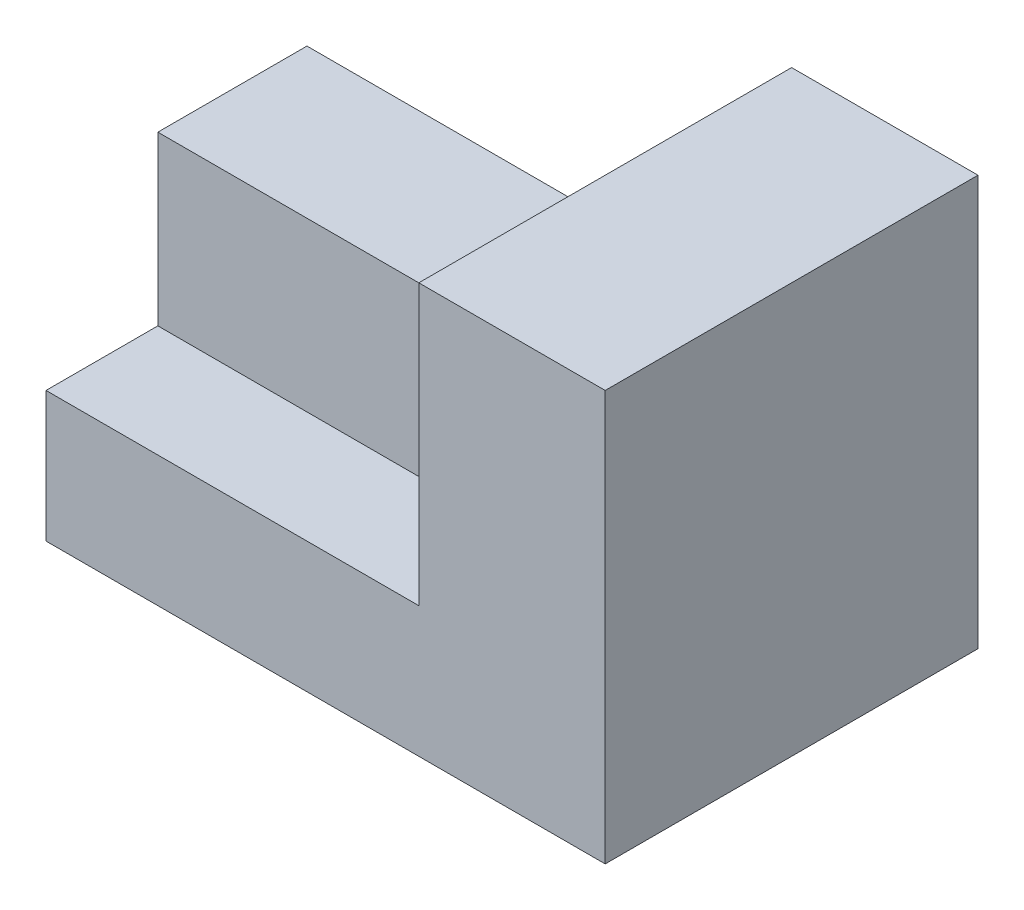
ISO-10303-21;
HEADER;
FILE_DESCRIPTION(('STEP AP214'),'2;1');
FILE_NAME('part.step','',(''),(''),'','','');
FILE_SCHEMA(('AUTOMOTIVE_DESIGN { 1 0 10303 214 1 1 1 1 }'));
ENDSEC;
DATA;
#1=APPLICATION_CONTEXT('core data for automotive mechanical design processes');
#2=APPLICATION_PROTOCOL_DEFINITION('international standard','automotive_design',2000,#1);
#3=PRODUCT_CONTEXT('',#1,'mechanical');
#4=PRODUCT('Part','Part','',(#3));
#5=PRODUCT_RELATED_PRODUCT_CATEGORY('part','',(#4));
#6=PRODUCT_DEFINITION_FORMATION('','',#4);
#7=PRODUCT_DEFINITION_CONTEXT('part definition',#1,'design');
#8=PRODUCT_DEFINITION('design','',#6,#7);
#9=PRODUCT_DEFINITION_SHAPE('','',#8);
#10=(LENGTH_UNIT() NAMED_UNIT(*) SI_UNIT(.MILLI.,.METRE.));
#11=(NAMED_UNIT(*) PLANE_ANGLE_UNIT() SI_UNIT($,.RADIAN.));
#12=(NAMED_UNIT(*) SI_UNIT($,.STERADIAN.) SOLID_ANGLE_UNIT());
#13=UNCERTAINTY_MEASURE_WITH_UNIT(LENGTH_MEASURE(1.E-05),#10,'distance_accuracy_value','');
#14=(GEOMETRIC_REPRESENTATION_CONTEXT(3) GLOBAL_UNCERTAINTY_ASSIGNED_CONTEXT((#13)) GLOBAL_UNIT_ASSIGNED_CONTEXT((#10,
#11,#12)) REPRESENTATION_CONTEXT('',''));
#15=CARTESIAN_POINT('',(0.,0.,0.));
#16=DIRECTION('',(0.,0.,1.));
#17=DIRECTION('',(1.,0.,0.));
#18=AXIS2_PLACEMENT_3D('',#15,#16,#17);
#19=CARTESIAN_POINT('',(0.,16.,10.));
#20=DIRECTION('',(1.,0.,0.));
#21=DIRECTION('',(0.,0.,-1.));
#22=AXIS2_PLACEMENT_3D('',#19,#20,#21);
#23=PLANE('',#22);
#24=DIRECTION('',(0.,1.,0.));
#25=VECTOR('',#24,1.);
#26=CARTESIAN_POINT('',(0.,16.,-4.));
#27=LINE('',#26,#25);
#28=CARTESIAN_POINT('',(0.,7.,-4.));
#29=VERTEX_POINT('',#28);
#30=CARTESIAN_POINT('',(0.,16.,-4.));
#31=VERTEX_POINT('',#30);
#32=EDGE_CURVE('E132',#29,#31,#27,.T.);
#33=ORIENTED_EDGE('',*,*,#32,.F.);
#34=DIRECTION('',(0.,0.,1.));
#35=VECTOR('',#34,1.);
#36=CARTESIAN_POINT('',(0.,7.,10.));
#37=LINE('',#36,#35);
#38=CARTESIAN_POINT('',(0.,7.,-10.));
#39=VERTEX_POINT('',#38);
#40=EDGE_CURVE('E124',#39,#29,#37,.T.);
#41=ORIENTED_EDGE('',*,*,#40,.F.);
#42=DIRECTION('',(0.,-1.,0.));
#43=VECTOR('',#42,1.);
#44=CARTESIAN_POINT('',(0.,16.,-10.));
#45=LINE('',#44,#43);
#46=CARTESIAN_POINT('',(0.,0.,-10.));
#47=VERTEX_POINT('',#46);
#48=EDGE_CURVE('E146',#39,#47,#45,.T.);
#49=ORIENTED_EDGE('',*,*,#48,.T.);
#50=DIRECTION('',(0.,0.,-1.));
#51=VECTOR('',#50,1.);
#52=CARTESIAN_POINT('',(0.,0.,10.));
#53=LINE('',#52,#51);
#54=CARTESIAN_POINT('',(0.,0.,10.));
#55=VERTEX_POINT('',#54);
#56=EDGE_CURVE('E178',#55,#47,#53,.T.);
#57=ORIENTED_EDGE('',*,*,#56,.F.);
#58=DIRECTION('',(0.,-1.,0.));
#59=VECTOR('',#58,1.);
#60=CARTESIAN_POINT('',(0.,16.,10.));
#61=LINE('',#60,#59);
#62=CARTESIAN_POINT('',(0.,7.,10.));
#63=VERTEX_POINT('',#62);
#64=EDGE_CURVE('E147',#63,#55,#61,.T.);
#65=ORIENTED_EDGE('',*,*,#64,.F.);
#66=DIRECTION('',(0.,0.,1.));
#67=VECTOR('',#66,1.);
#68=CARTESIAN_POINT('',(0.,7.,10.));
#69=LINE('',#68,#67);
#70=CARTESIAN_POINT('',(0.,7.,4.));
#71=VERTEX_POINT('',#70);
#72=EDGE_CURVE('E53',#71,#63,#69,.T.);
#73=ORIENTED_EDGE('',*,*,#72,.F.);
#74=DIRECTION('',(0.,1.,0.));
#75=VECTOR('',#74,1.);
#76=CARTESIAN_POINT('',(0.,16.,4.));
#77=LINE('',#76,#75);
#78=CARTESIAN_POINT('',(0.,16.,4.));
#79=VERTEX_POINT('',#78);
#80=EDGE_CURVE('E143',#71,#79,#77,.T.);
#81=ORIENTED_EDGE('',*,*,#80,.T.);
#82=DIRECTION('',(0.,0.,-1.));
#83=VECTOR('',#82,1.);
#84=CARTESIAN_POINT('',(0.,16.,10.));
#85=LINE('',#84,#83);
#86=EDGE_CURVE('E157',#79,#31,#85,.T.);
#87=ORIENTED_EDGE('',*,*,#86,.T.);
#88=EDGE_LOOP('',(#33,#41,#49,#57,#65,#73,#81,#87));
#89=FACE_BOUND('',#88,.T.);
#90=ADVANCED_FACE('F31',(#89),#23,.F.);
#91=CARTESIAN_POINT('',(20.,16.,10.));
#92=DIRECTION('',(0.,-1.,0.));
#93=DIRECTION('',(0.,0.,-1.));
#94=AXIS2_PLACEMENT_3D('',#91,#92,#93);
#95=PLANE('',#94);
#96=DIRECTION('',(-1.,0.,0.));
#97=VECTOR('',#96,1.);
#98=CARTESIAN_POINT('',(-1.18773946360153,16.,-4.));
#99=LINE('',#98,#97);
#100=CARTESIAN_POINT('',(20.,16.,-4.));
#101=VERTEX_POINT('',#100);
#102=EDGE_CURVE('E122',#101,#31,#99,.T.);
#103=ORIENTED_EDGE('',*,*,#102,.T.);
#104=ORIENTED_EDGE('',*,*,#86,.F.);
#105=DIRECTION('',(-1.,0.,0.));
#106=VECTOR('',#105,1.);
#107=CARTESIAN_POINT('',(-1.18773946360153,16.,4.));
#108=LINE('',#107,#106);
#109=CARTESIAN_POINT('',(20.,16.,4.));
#110=VERTEX_POINT('',#109);
#111=EDGE_CURVE('E134',#110,#79,#108,.T.);
#112=ORIENTED_EDGE('',*,*,#111,.F.);
#113=DIRECTION('',(0.,0.,-1.));
#114=VECTOR('',#113,1.);
#115=CARTESIAN_POINT('',(20.,16.,10.));
#116=LINE('',#115,#114);
#117=EDGE_CURVE('E168',#110,#101,#116,.T.);
#118=ORIENTED_EDGE('',*,*,#117,.T.);
#119=EDGE_LOOP('',(#103,#104,#112,#118));
#120=FACE_BOUND('',#119,.T.);
#121=ADVANCED_FACE('F211',(#120),#95,.F.);
#122=CARTESIAN_POINT('',(0.,0.,-10.));
#123=DIRECTION('',(0.,0.,1.));
#124=DIRECTION('',(1.,0.,0.));
#125=AXIS2_PLACEMENT_3D('',#122,#123,#124);
#126=PLANE('',#125);
#127=DIRECTION('',(-1.,0.,0.));
#128=VECTOR('',#127,1.);
#129=CARTESIAN_POINT('',(0.,7.,-10.));
#130=LINE('',#129,#128);
#131=CARTESIAN_POINT('',(20.,7.,-10.));
#132=VERTEX_POINT('',#131);
#133=EDGE_CURVE('E11',#132,#39,#130,.T.);
#134=ORIENTED_EDGE('',*,*,#133,.F.);
#135=DIRECTION('',(0.,-1.,0.));
#136=VECTOR('',#135,1.);
#137=CARTESIAN_POINT('',(20.,22.,-10.));
#138=LINE('',#137,#136);
#139=CARTESIAN_POINT('',(20.,22.,-10.));
#140=VERTEX_POINT('',#139);
#141=EDGE_CURVE('E45',#140,#132,#138,.T.);
#142=ORIENTED_EDGE('',*,*,#141,.F.);
#143=DIRECTION('',(-1.,0.,0.));
#144=VECTOR('',#143,1.);
#145=CARTESIAN_POINT('',(30.,22.,-10.));
#146=LINE('',#145,#144);
#147=CARTESIAN_POINT('',(30.,22.,-10.));
#148=VERTEX_POINT('',#147);
#149=EDGE_CURVE('E163',#148,#140,#146,.T.);
#150=ORIENTED_EDGE('',*,*,#149,.F.);
#151=DIRECTION('',(0.,1.,0.));
#152=VECTOR('',#151,1.);
#153=CARTESIAN_POINT('',(30.,0.,-10.));
#154=LINE('',#153,#152);
#155=CARTESIAN_POINT('',(30.,0.,-10.));
#156=VERTEX_POINT('',#155);
#157=EDGE_CURVE('E161',#156,#148,#154,.T.);
#158=ORIENTED_EDGE('',*,*,#157,.F.);
#159=DIRECTION('',(1.,0.,0.));
#160=VECTOR('',#159,1.);
#161=CARTESIAN_POINT('',(0.,0.,-10.));
#162=LINE('',#161,#160);
#163=EDGE_CURVE('E159',#47,#156,#162,.T.);
#164=ORIENTED_EDGE('',*,*,#163,.F.);
#165=ORIENTED_EDGE('',*,*,#48,.F.);
#166=EDGE_LOOP('',(#134,#142,#150,#158,#164,#165));
#167=FACE_BOUND('',#166,.T.);
#168=ADVANCED_FACE('F213',(#167),#126,.F.);
#169=CARTESIAN_POINT('',(0.,0.,10.));
#170=DIRECTION('',(0.,1.,0.));
#171=DIRECTION('',(0.,0.,1.));
#172=AXIS2_PLACEMENT_3D('',#169,#170,#171);
#173=PLANE('',#172);
#174=ORIENTED_EDGE('',*,*,#163,.T.);
#175=DIRECTION('',(0.,0.,-1.));
#176=VECTOR('',#175,1.);
#177=CARTESIAN_POINT('',(30.,0.,10.));
#178=LINE('',#177,#176);
#179=CARTESIAN_POINT('',(30.,0.,10.));
#180=VERTEX_POINT('',#179);
#181=EDGE_CURVE('E175',#180,#156,#178,.T.);
#182=ORIENTED_EDGE('',*,*,#181,.F.);
#183=DIRECTION('',(1.,0.,0.));
#184=VECTOR('',#183,1.);
#185=CARTESIAN_POINT('',(0.,0.,10.));
#186=LINE('',#185,#184);
#187=EDGE_CURVE('E149',#55,#180,#186,.T.);
#188=ORIENTED_EDGE('',*,*,#187,.F.);
#189=ORIENTED_EDGE('',*,*,#56,.T.);
#190=EDGE_LOOP('',(#174,#182,#188,#189));
#191=FACE_BOUND('',#190,.T.);
#192=ADVANCED_FACE('F191',(#191),#173,.F.);
#193=CARTESIAN_POINT('',(30.,0.,10.));
#194=DIRECTION('',(-1.,0.,0.));
#195=DIRECTION('',(0.,0.,1.));
#196=AXIS2_PLACEMENT_3D('',#193,#194,#195);
#197=PLANE('',#196);
#198=ORIENTED_EDGE('',*,*,#157,.T.);
#199=DIRECTION('',(0.,0.,-1.));
#200=VECTOR('',#199,1.);
#201=CARTESIAN_POINT('',(30.,22.,10.));
#202=LINE('',#201,#200);
#203=CARTESIAN_POINT('',(30.,22.,10.));
#204=VERTEX_POINT('',#203);
#205=EDGE_CURVE('E172',#204,#148,#202,.T.);
#206=ORIENTED_EDGE('',*,*,#205,.F.);
#207=DIRECTION('',(0.,1.,0.));
#208=VECTOR('',#207,1.);
#209=CARTESIAN_POINT('',(30.,0.,10.));
#210=LINE('',#209,#208);
#211=EDGE_CURVE('E151',#180,#204,#210,.T.);
#212=ORIENTED_EDGE('',*,*,#211,.F.);
#213=ORIENTED_EDGE('',*,*,#181,.T.);
#214=EDGE_LOOP('',(#198,#206,#212,#213));
#215=FACE_BOUND('',#214,.T.);
#216=ADVANCED_FACE('F198',(#215),#197,.F.);
#217=CARTESIAN_POINT('',(30.,22.,10.));
#218=DIRECTION('',(0.,-1.,0.));
#219=DIRECTION('',(0.,0.,-1.));
#220=AXIS2_PLACEMENT_3D('',#217,#218,#219);
#221=PLANE('',#220);
#222=ORIENTED_EDGE('',*,*,#149,.T.);
#223=DIRECTION('',(0.,0.,-1.));
#224=VECTOR('',#223,1.);
#225=CARTESIAN_POINT('',(20.,22.,10.));
#226=LINE('',#225,#224);
#227=CARTESIAN_POINT('',(20.,22.,10.));
#228=VERTEX_POINT('',#227);
#229=EDGE_CURVE('E170',#228,#140,#226,.T.);
#230=ORIENTED_EDGE('',*,*,#229,.F.);
#231=DIRECTION('',(-1.,0.,0.));
#232=VECTOR('',#231,1.);
#233=CARTESIAN_POINT('',(30.,22.,10.));
#234=LINE('',#233,#232);
#235=EDGE_CURVE('E153',#204,#228,#234,.T.);
#236=ORIENTED_EDGE('',*,*,#235,.F.);
#237=ORIENTED_EDGE('',*,*,#205,.T.);
#238=EDGE_LOOP('',(#222,#230,#236,#237));
#239=FACE_BOUND('',#238,.T.);
#240=ADVANCED_FACE('F202',(#239),#221,.F.);
#241=CARTESIAN_POINT('',(20.,22.,10.));
#242=DIRECTION('',(1.,0.,0.));
#243=DIRECTION('',(0.,0.,-1.));
#244=AXIS2_PLACEMENT_3D('',#241,#242,#243);
#245=PLANE('',#244);
#246=ORIENTED_EDGE('',*,*,#141,.T.);
#247=DIRECTION('',(0.,0.,1.));
#248=VECTOR('',#247,1.);
#249=CARTESIAN_POINT('',(20.,7.,-4.));
#250=LINE('',#249,#248);
#251=CARTESIAN_POINT('',(20.,7.,-4.));
#252=VERTEX_POINT('',#251);
#253=EDGE_CURVE('E106',#132,#252,#250,.T.);
#254=ORIENTED_EDGE('',*,*,#253,.T.);
#255=DIRECTION('',(0.,1.,0.));
#256=VECTOR('',#255,1.);
#257=CARTESIAN_POINT('',(20.,7.,-4.));
#258=LINE('',#257,#256);
#259=EDGE_CURVE('E110',#252,#101,#258,.T.);
#260=ORIENTED_EDGE('',*,*,#259,.T.);
#261=ORIENTED_EDGE('',*,*,#117,.F.);
#262=DIRECTION('',(0.,1.,0.));
#263=VECTOR('',#262,1.);
#264=CARTESIAN_POINT('',(20.,7.,4.));
#265=LINE('',#264,#263);
#266=CARTESIAN_POINT('',(20.,7.,4.));
#267=VERTEX_POINT('',#266);
#268=EDGE_CURVE('E139',#267,#110,#265,.T.);
#269=ORIENTED_EDGE('',*,*,#268,.F.);
#270=DIRECTION('',(0.,0.,-1.));
#271=VECTOR('',#270,1.);
#272=CARTESIAN_POINT('',(20.,7.,4.));
#273=LINE('',#272,#271);
#274=CARTESIAN_POINT('',(20.,7.,10.));
#275=VERTEX_POINT('',#274);
#276=EDGE_CURVE('E135',#275,#267,#273,.T.);
#277=ORIENTED_EDGE('',*,*,#276,.F.);
#278=DIRECTION('',(0.,-1.,0.));
#279=VECTOR('',#278,1.);
#280=CARTESIAN_POINT('',(20.,22.,10.));
#281=LINE('',#280,#279);
#282=EDGE_CURVE('E155',#228,#275,#281,.T.);
#283=ORIENTED_EDGE('',*,*,#282,.F.);
#284=ORIENTED_EDGE('',*,*,#229,.T.);
#285=EDGE_LOOP('',(#246,#254,#260,#261,#269,#277,#283,#284));
#286=FACE_BOUND('',#285,.T.);
#287=ADVANCED_FACE('F108',(#286),#245,.F.);
#288=CARTESIAN_POINT('',(0.,0.,10.));
#289=DIRECTION('',(0.,0.,1.));
#290=DIRECTION('',(1.,0.,0.));
#291=AXIS2_PLACEMENT_3D('',#288,#289,#290);
#292=PLANE('',#291);
#293=ORIENTED_EDGE('',*,*,#282,.T.);
#294=DIRECTION('',(-1.,0.,0.));
#295=VECTOR('',#294,1.);
#296=CARTESIAN_POINT('',(0.,7.,10.));
#297=LINE('',#296,#295);
#298=EDGE_CURVE('E38',#275,#63,#297,.T.);
#299=ORIENTED_EDGE('',*,*,#298,.T.);
#300=ORIENTED_EDGE('',*,*,#64,.T.);
#301=ORIENTED_EDGE('',*,*,#187,.T.);
#302=ORIENTED_EDGE('',*,*,#211,.T.);
#303=ORIENTED_EDGE('',*,*,#235,.T.);
#304=EDGE_LOOP('',(#293,#299,#300,#301,#302,#303));
#305=FACE_BOUND('',#304,.T.);
#306=ADVANCED_FACE('F182',(#305),#292,.T.);
#307=CARTESIAN_POINT('',(-1.18773946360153,7.,4.));
#308=DIRECTION('',(0.,0.,-1.));
#309=DIRECTION('',(-1.,0.,0.));
#310=AXIS2_PLACEMENT_3D('',#307,#308,#309);
#311=PLANE('',#310);
#312=DIRECTION('',(-1.,0.,0.));
#313=VECTOR('',#312,1.);
#314=CARTESIAN_POINT('',(-1.18773946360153,7.,4.));
#315=LINE('',#314,#313);
#316=EDGE_CURVE('E137',#267,#71,#315,.T.);
#317=ORIENTED_EDGE('',*,*,#316,.F.);
#318=ORIENTED_EDGE('',*,*,#268,.T.);
#319=ORIENTED_EDGE('',*,*,#111,.T.);
#320=ORIENTED_EDGE('',*,*,#80,.F.);
#321=EDGE_LOOP('',(#317,#318,#319,#320));
#322=FACE_BOUND('',#321,.T.);
#323=ADVANCED_FACE('F207',(#322),#311,.F.);
#324=CARTESIAN_POINT('',(-1.18773946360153,7.,12.9080459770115));
#325=DIRECTION('',(0.,1.,0.));
#326=DIRECTION('',(0.,0.,1.));
#327=AXIS2_PLACEMENT_3D('',#324,#325,#326);
#328=PLANE('',#327);
#329=ORIENTED_EDGE('',*,*,#72,.T.);
#330=ORIENTED_EDGE('',*,*,#298,.F.);
#331=ORIENTED_EDGE('',*,*,#276,.T.);
#332=ORIENTED_EDGE('',*,*,#316,.T.);
#333=EDGE_LOOP('',(#329,#330,#331,#332));
#334=FACE_BOUND('',#333,.T.);
#335=ADVANCED_FACE('F205',(#334),#328,.T.);
#336=CARTESIAN_POINT('',(-1.18773946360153,7.,-4.));
#337=DIRECTION('',(0.,0.,-1.));
#338=DIRECTION('',(-1.,0.,0.));
#339=AXIS2_PLACEMENT_3D('',#336,#337,#338);
#340=PLANE('',#339);
#341=ORIENTED_EDGE('',*,*,#32,.T.);
#342=ORIENTED_EDGE('',*,*,#102,.F.);
#343=ORIENTED_EDGE('',*,*,#259,.F.);
#344=DIRECTION('',(-1.,0.,0.));
#345=VECTOR('',#344,1.);
#346=CARTESIAN_POINT('',(-1.18773946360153,7.,-4.));
#347=LINE('',#346,#345);
#348=EDGE_CURVE('E115',#252,#29,#347,.T.);
#349=ORIENTED_EDGE('',*,*,#348,.T.);
#350=EDGE_LOOP('',(#341,#342,#343,#349));
#351=FACE_BOUND('',#350,.T.);
#352=ADVANCED_FACE('F119',(#351),#340,.T.);
#353=CARTESIAN_POINT('',(-1.18773946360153,7.,-12.9080459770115));
#354=DIRECTION('',(0.,1.,0.));
#355=DIRECTION('',(0.,0.,-1.));
#356=AXIS2_PLACEMENT_3D('',#353,#354,#355);
#357=PLANE('',#356);
#358=ORIENTED_EDGE('',*,*,#40,.T.);
#359=ORIENTED_EDGE('',*,*,#348,.F.);
#360=ORIENTED_EDGE('',*,*,#253,.F.);
#361=ORIENTED_EDGE('',*,*,#133,.T.);
#362=EDGE_LOOP('',(#358,#359,#360,#361));
#363=FACE_BOUND('',#362,.T.);
#364=ADVANCED_FACE('F126',(#363),#357,.T.);
#365=CLOSED_SHELL('',(#90,#121,#168,#192,#216,#240,#287,#306,#323,#335,#352,#364));
#366=MANIFOLD_SOLID_BREP('B2',#365);
#367=ADVANCED_BREP_SHAPE_REPRESENTATION('',(#18,#366),#14);
#368=SHAPE_DEFINITION_REPRESENTATION(#9,#367);
ENDSEC;
END-ISO-10303-21;
